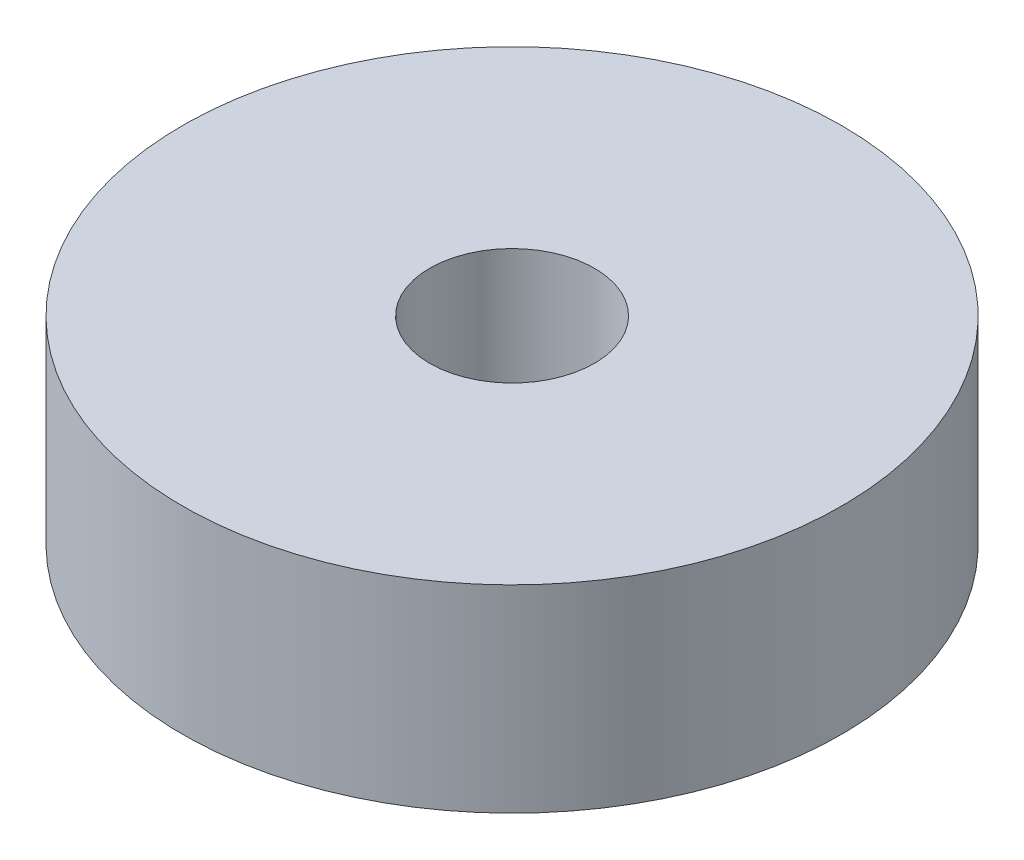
ISO-10303-21;
HEADER;
FILE_DESCRIPTION(('STEP AP214'),'2;1');
FILE_NAME('part.step','',(''),(''),'','','');
FILE_SCHEMA(('AUTOMOTIVE_DESIGN { 1 0 10303 214 1 1 1 1 }'));
ENDSEC;
DATA;
#1=APPLICATION_CONTEXT('core data for automotive mechanical design processes');
#2=APPLICATION_PROTOCOL_DEFINITION('international standard','automotive_design',2000,#1);
#3=PRODUCT_CONTEXT('',#1,'mechanical');
#4=PRODUCT('Part','Part','',(#3));
#5=PRODUCT_RELATED_PRODUCT_CATEGORY('part','',(#4));
#6=PRODUCT_DEFINITION_FORMATION('','',#4);
#7=PRODUCT_DEFINITION_CONTEXT('part definition',#1,'design');
#8=PRODUCT_DEFINITION('design','',#6,#7);
#9=PRODUCT_DEFINITION_SHAPE('','',#8);
#10=(LENGTH_UNIT() NAMED_UNIT(*) SI_UNIT(.MILLI.,.METRE.));
#11=(NAMED_UNIT(*) PLANE_ANGLE_UNIT() SI_UNIT($,.RADIAN.));
#12=(NAMED_UNIT(*) SI_UNIT($,.STERADIAN.) SOLID_ANGLE_UNIT());
#13=UNCERTAINTY_MEASURE_WITH_UNIT(LENGTH_MEASURE(1.E-05),#10,'distance_accuracy_value','');
#14=(GEOMETRIC_REPRESENTATION_CONTEXT(3) GLOBAL_UNCERTAINTY_ASSIGNED_CONTEXT((#13)) GLOBAL_UNIT_ASSIGNED_CONTEXT((#10,
#11,#12)) REPRESENTATION_CONTEXT('',''));
#15=CARTESIAN_POINT('',(0.,0.,0.));
#16=DIRECTION('',(0.,0.,1.));
#17=DIRECTION('',(1.,0.,0.));
#18=AXIS2_PLACEMENT_3D('',#15,#16,#17);
#19=CARTESIAN_POINT('',(0.,0.,0.));
#20=DIRECTION('',(0.,1.,0.));
#21=DIRECTION('',(0.,0.,1.));
#22=AXIS2_PLACEMENT_3D('',#19,#20,#21);
#23=PLANE('',#22);
#24=CARTESIAN_POINT('',(0.,0.,0.));
#25=DIRECTION('',(0.,1.,0.));
#26=DIRECTION('',(0.,0.,1.));
#27=AXIS2_PLACEMENT_3D('',#24,#25,#26);
#28=CIRCLE('',#27,3.175);
#29=CARTESIAN_POINT('',(0.,0.,3.175));
#30=VERTEX_POINT('',#29);
#31=EDGE_CURVE('E55',#30,#30,#28,.T.);
#32=ORIENTED_EDGE('',*,*,#31,.T.);
#33=EDGE_LOOP('',(#32));
#34=FACE_BOUND('',#33,.T.);
#35=CARTESIAN_POINT('',(0.,0.,0.));
#36=DIRECTION('',(0.,-1.,0.));
#37=DIRECTION('',(0.,0.,-1.));
#38=AXIS2_PLACEMENT_3D('',#35,#36,#37);
#39=CIRCLE('',#38,5.715);
#40=CARTESIAN_POINT('',(0.,0.,-5.715));
#41=VERTEX_POINT('',#40);
#42=EDGE_CURVE('E66',#41,#41,#39,.T.);
#43=ORIENTED_EDGE('',*,*,#42,.T.);
#44=EDGE_LOOP('',(#43));
#45=FACE_BOUND('',#44,.T.);
#46=ADVANCED_FACE('F31',(#34,#45),#23,.F.);
#47=CARTESIAN_POINT('',(0.,7.62,0.));
#48=DIRECTION('',(0.,-1.,0.));
#49=DIRECTION('',(0.,0.,-1.));
#50=AXIS2_PLACEMENT_3D('',#47,#48,#49);
#51=CYLINDRICAL_SURFACE('',#50,12.7);
#52=CARTESIAN_POINT('',(0.,7.62,0.));
#53=DIRECTION('',(0.,1.,0.));
#54=DIRECTION('',(0.,0.,1.));
#55=AXIS2_PLACEMENT_3D('',#52,#53,#54);
#56=CIRCLE('',#55,12.7);
#57=CARTESIAN_POINT('',(0.,7.62,-12.7));
#58=VERTEX_POINT('',#57);
#59=EDGE_CURVE('E51',#58,#58,#56,.T.);
#60=CARTESIAN_POINT('',(0.,0.,0.));
#61=DIRECTION('',(0.,1.,0.));
#62=DIRECTION('',(0.,0.,1.));
#63=AXIS2_PLACEMENT_3D('',#60,#61,#62);
#64=CIRCLE('',#63,12.7);
#65=CARTESIAN_POINT('',(0.,0.,-12.7));
#66=VERTEX_POINT('',#65);
#67=EDGE_CURVE('E52',#66,#66,#64,.T.);
#68=CARTESIAN_POINT('',(0.,7.62,-12.7));
#69=CARTESIAN_POINT('',(0.,7.540625,-12.7));
#70=CARTESIAN_POINT('',(0.,7.46125,-12.7));
#71=CARTESIAN_POINT('',(0.,7.3025,-12.7));
#72=CARTESIAN_POINT('',(0.,7.223125,-12.7));
#73=CARTESIAN_POINT('',(0.,7.064375,-12.7));
#74=CARTESIAN_POINT('',(0.,6.985,-12.7));
#75=CARTESIAN_POINT('',(0.,6.82625,-12.7));
#76=CARTESIAN_POINT('',(0.,6.746875,-12.7));
#77=CARTESIAN_POINT('',(0.,6.588125,-12.7));
#78=CARTESIAN_POINT('',(0.,6.50875,-12.7));
#79=CARTESIAN_POINT('',(0.,6.35,-12.7));
#80=CARTESIAN_POINT('',(0.,6.270625,-12.7));
#81=CARTESIAN_POINT('',(0.,6.111875,-12.7));
#82=CARTESIAN_POINT('',(0.,6.0325,-12.7));
#83=CARTESIAN_POINT('',(0.,5.87375,-12.7));
#84=CARTESIAN_POINT('',(0.,5.794375,-12.7));
#85=CARTESIAN_POINT('',(0.,5.635625,-12.7));
#86=CARTESIAN_POINT('',(0.,5.55625,-12.7));
#87=CARTESIAN_POINT('',(0.,5.3975,-12.7));
#88=CARTESIAN_POINT('',(0.,5.318125,-12.7));
#89=CARTESIAN_POINT('',(0.,5.159375,-12.7));
#90=CARTESIAN_POINT('',(0.,5.08,-12.7));
#91=CARTESIAN_POINT('',(0.,4.92125,-12.7));
#92=CARTESIAN_POINT('',(0.,4.841875,-12.7));
#93=CARTESIAN_POINT('',(0.,4.683125,-12.7));
#94=CARTESIAN_POINT('',(0.,4.60375,-12.7));
#95=CARTESIAN_POINT('',(0.,4.445,-12.7));
#96=CARTESIAN_POINT('',(0.,4.365625,-12.7));
#97=CARTESIAN_POINT('',(0.,4.206875,-12.7));
#98=CARTESIAN_POINT('',(0.,4.1275,-12.7));
#99=CARTESIAN_POINT('',(0.,3.96875,-12.7));
#100=CARTESIAN_POINT('',(0.,3.889375,-12.7));
#101=CARTESIAN_POINT('',(0.,3.730625,-12.7));
#102=CARTESIAN_POINT('',(0.,3.65125,-12.7));
#103=CARTESIAN_POINT('',(0.,3.4925,-12.7));
#104=CARTESIAN_POINT('',(0.,3.413125,-12.7));
#105=CARTESIAN_POINT('',(0.,3.254375,-12.7));
#106=CARTESIAN_POINT('',(0.,3.175,-12.7));
#107=CARTESIAN_POINT('',(0.,3.01625,-12.7));
#108=CARTESIAN_POINT('',(0.,2.936875,-12.7));
#109=CARTESIAN_POINT('',(0.,2.778125,-12.7));
#110=CARTESIAN_POINT('',(0.,2.69875,-12.7));
#111=CARTESIAN_POINT('',(0.,2.54,-12.7));
#112=CARTESIAN_POINT('',(0.,2.460625,-12.7));
#113=CARTESIAN_POINT('',(0.,2.301875,-12.7));
#114=CARTESIAN_POINT('',(0.,2.2225,-12.7));
#115=CARTESIAN_POINT('',(0.,2.06375,-12.7));
#116=CARTESIAN_POINT('',(0.,1.984375,-12.7));
#117=CARTESIAN_POINT('',(0.,1.825625,-12.7));
#118=CARTESIAN_POINT('',(0.,1.74625,-12.7));
#119=CARTESIAN_POINT('',(0.,1.5875,-12.7));
#120=CARTESIAN_POINT('',(0.,1.508125,-12.7));
#121=CARTESIAN_POINT('',(0.,1.349375,-12.7));
#122=CARTESIAN_POINT('',(0.,1.27,-12.7));
#123=CARTESIAN_POINT('',(0.,1.11125,-12.7));
#124=CARTESIAN_POINT('',(0.,1.031875,-12.7));
#125=CARTESIAN_POINT('',(0.,0.873125,-12.7));
#126=CARTESIAN_POINT('',(0.,0.79375,-12.7));
#127=CARTESIAN_POINT('',(0.,0.635,-12.7));
#128=CARTESIAN_POINT('',(0.,0.555625,-12.7));
#129=CARTESIAN_POINT('',(0.,0.396875,-12.7));
#130=CARTESIAN_POINT('',(0.,0.3175,-12.7));
#131=CARTESIAN_POINT('',(0.,0.15875,-12.7));
#132=CARTESIAN_POINT('',(0.,0.0793749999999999,-12.7));
#133=CARTESIAN_POINT('',(0.,0.,-12.7));
#134=B_SPLINE_CURVE_WITH_KNOTS('',3,(#68,#69,#70,#71,#72,#73,#74,#75,#76,#77,#78,#79,#80,#81,
#82,#83,#84,#85,#86,#87,#88,#89,#90,#91,#92,#93,#94,#95,#96,#97,#98,#99,#100,#101,#102,#103,
#104,#105,#106,#107,#108,#109,#110,#111,#112,#113,#114,#115,#116,#117,#118,#119,#120,#121,#122,
#123,#124,#125,#126,#127,#128,#129,#130,#131,#132,#133),.UNSPECIFIED.,.F.,.F.,(4,2,2,2,2,2,2,2,
2,2,2,2,2,2,2,2,2,2,2,2,2,2,2,2,2,2,2,2,2,2,2,2,4),(0.,0.238125,0.47625,0.714375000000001,
0.9525,1.190625,1.42875,1.666875,1.905,2.143125,2.38125,2.619375,2.8575,3.095625,3.33375,
3.571875,3.81,4.048125,4.28625,4.524375,4.7625,5.000625,5.23875,5.476875,5.715,5.953125,6.19125,
6.429375,6.6675,6.905625,7.14375,7.381875,7.62),.UNSPECIFIED.);
#135=EDGE_CURVE('BSEAM85',#58,#66,#134,.T.);
#136=ORIENTED_EDGE('',*,*,#59,.F.);
#137=ORIENTED_EDGE('',*,*,#67,.T.);
#138=ORIENTED_EDGE('',*,*,#135,.T.);
#139=ORIENTED_EDGE('',*,*,#135,.F.);
#140=EDGE_LOOP('',(#136,#138,#137,#139));
#141=FACE_BOUND('',#140,.T.);
#142=ADVANCED_FACE('F85',(#141),#51,.T.);
#143=CARTESIAN_POINT('',(0.,7.62,0.));
#144=DIRECTION('',(0.,1.,0.));
#145=DIRECTION('',(0.,0.,1.));
#146=AXIS2_PLACEMENT_3D('',#143,#144,#145);
#147=PLANE('',#146);
#148=CARTESIAN_POINT('',(0.,7.62,0.));
#149=DIRECTION('',(0.,1.,0.));
#150=DIRECTION('',(0.,0.,1.));
#151=AXIS2_PLACEMENT_3D('',#148,#149,#150);
#152=CIRCLE('',#151,3.175);
#153=CARTESIAN_POINT('',(0.,7.62,3.175));
#154=VERTEX_POINT('',#153);
#155=EDGE_CURVE('E58',#154,#154,#152,.T.);
#156=ORIENTED_EDGE('',*,*,#155,.F.);
#157=EDGE_LOOP('',(#156));
#158=FACE_BOUND('',#157,.T.);
#159=ORIENTED_EDGE('',*,*,#59,.T.);
#160=EDGE_LOOP('',(#159));
#161=FACE_BOUND('',#160,.T.);
#162=ADVANCED_FACE('F92',(#158,#161),#147,.T.);
#163=CARTESIAN_POINT('',(0.,0.,0.));
#164=DIRECTION('',(0.,-1.,0.));
#165=DIRECTION('',(0.,0.,-1.));
#166=AXIS2_PLACEMENT_3D('',#163,#164,#165);
#167=CIRCLE('',#166,10.16);
#168=CARTESIAN_POINT('',(0.,0.,-10.16));
#169=VERTEX_POINT('',#168);
#170=EDGE_CURVE('E61',#169,#169,#167,.T.);
#171=ORIENTED_EDGE('',*,*,#170,.F.);
#172=EDGE_LOOP('',(#171));
#173=FACE_BOUND('',#172,.T.);
#174=ORIENTED_EDGE('',*,*,#67,.F.);
#175=EDGE_LOOP('',(#174));
#176=FACE_BOUND('',#175,.T.);
#177=ADVANCED_FACE('F88',(#173,#176),#23,.F.);
#178=CARTESIAN_POINT('',(0.,0.,0.));
#179=DIRECTION('',(0.,1.,0.));
#180=DIRECTION('',(0.,0.,1.));
#181=AXIS2_PLACEMENT_3D('',#178,#179,#180);
#182=CYLINDRICAL_SURFACE('',#181,3.175);
#183=CARTESIAN_POINT('',(0.,0.,3.175));
#184=CARTESIAN_POINT('',(0.,0.0793749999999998,3.175));
#185=CARTESIAN_POINT('',(0.,0.15875,3.175));
#186=CARTESIAN_POINT('',(0.,0.3175,3.175));
#187=CARTESIAN_POINT('',(0.,0.396875,3.175));
#188=CARTESIAN_POINT('',(0.,0.555625,3.175));
#189=CARTESIAN_POINT('',(0.,0.635,3.175));
#190=CARTESIAN_POINT('',(0.,0.79375,3.175));
#191=CARTESIAN_POINT('',(0.,0.873125,3.175));
#192=CARTESIAN_POINT('',(0.,1.031875,3.175));
#193=CARTESIAN_POINT('',(0.,1.11125,3.175));
#194=CARTESIAN_POINT('',(0.,1.27,3.175));
#195=CARTESIAN_POINT('',(0.,1.349375,3.175));
#196=CARTESIAN_POINT('',(0.,1.508125,3.175));
#197=CARTESIAN_POINT('',(0.,1.5875,3.175));
#198=CARTESIAN_POINT('',(0.,1.74625,3.175));
#199=CARTESIAN_POINT('',(0.,1.825625,3.175));
#200=CARTESIAN_POINT('',(0.,1.984375,3.175));
#201=CARTESIAN_POINT('',(0.,2.06375,3.175));
#202=CARTESIAN_POINT('',(0.,2.2225,3.175));
#203=CARTESIAN_POINT('',(0.,2.301875,3.175));
#204=CARTESIAN_POINT('',(0.,2.460625,3.175));
#205=CARTESIAN_POINT('',(0.,2.54,3.175));
#206=CARTESIAN_POINT('',(0.,2.69875,3.175));
#207=CARTESIAN_POINT('',(0.,2.778125,3.175));
#208=CARTESIAN_POINT('',(0.,2.936875,3.175));
#209=CARTESIAN_POINT('',(0.,3.01625,3.175));
#210=CARTESIAN_POINT('',(0.,3.175,3.175));
#211=CARTESIAN_POINT('',(0.,3.254375,3.175));
#212=CARTESIAN_POINT('',(0.,3.413125,3.175));
#213=CARTESIAN_POINT('',(0.,3.4925,3.175));
#214=CARTESIAN_POINT('',(0.,3.65125,3.175));
#215=CARTESIAN_POINT('',(0.,3.730625,3.175));
#216=CARTESIAN_POINT('',(0.,3.889375,3.175));
#217=CARTESIAN_POINT('',(0.,3.96875,3.175));
#218=CARTESIAN_POINT('',(0.,4.1275,3.175));
#219=CARTESIAN_POINT('',(0.,4.206875,3.175));
#220=CARTESIAN_POINT('',(0.,4.365625,3.175));
#221=CARTESIAN_POINT('',(0.,4.445,3.175));
#222=CARTESIAN_POINT('',(0.,4.60375,3.175));
#223=CARTESIAN_POINT('',(0.,4.683125,3.175));
#224=CARTESIAN_POINT('',(0.,4.841875,3.175));
#225=CARTESIAN_POINT('',(0.,4.92125,3.175));
#226=CARTESIAN_POINT('',(0.,5.08,3.175));
#227=CARTESIAN_POINT('',(0.,5.159375,3.175));
#228=CARTESIAN_POINT('',(0.,5.318125,3.175));
#229=CARTESIAN_POINT('',(0.,5.3975,3.175));
#230=CARTESIAN_POINT('',(0.,5.55625,3.175));
#231=CARTESIAN_POINT('',(0.,5.635625,3.175));
#232=CARTESIAN_POINT('',(0.,5.794375,3.175));
#233=CARTESIAN_POINT('',(0.,5.87375,3.175));
#234=CARTESIAN_POINT('',(0.,6.0325,3.175));
#235=CARTESIAN_POINT('',(0.,6.111875,3.175));
#236=CARTESIAN_POINT('',(0.,6.270625,3.175));
#237=CARTESIAN_POINT('',(0.,6.35,3.175));
#238=CARTESIAN_POINT('',(0.,6.50875,3.175));
#239=CARTESIAN_POINT('',(0.,6.588125,3.175));
#240=CARTESIAN_POINT('',(0.,6.746875,3.175));
#241=CARTESIAN_POINT('',(0.,6.82625,3.175));
#242=CARTESIAN_POINT('',(0.,6.985,3.175));
#243=CARTESIAN_POINT('',(0.,7.064375,3.175));
#244=CARTESIAN_POINT('',(0.,7.223125,3.175));
#245=CARTESIAN_POINT('',(0.,7.3025,3.175));
#246=CARTESIAN_POINT('',(0.,7.46125,3.175));
#247=CARTESIAN_POINT('',(0.,7.540625,3.175));
#248=CARTESIAN_POINT('',(0.,7.62,3.175));
#249=B_SPLINE_CURVE_WITH_KNOTS('',3,(#183,#184,#185,#186,#187,#188,#189,#190,#191,#192,#193,
#194,#195,#196,#197,#198,#199,#200,#201,#202,#203,#204,#205,#206,#207,#208,#209,#210,#211,#212,
#213,#214,#215,#216,#217,#218,#219,#220,#221,#222,#223,#224,#225,#226,#227,#228,#229,#230,#231,
#232,#233,#234,#235,#236,#237,#238,#239,#240,#241,#242,#243,#244,#245,#246,#247,#248),
.UNSPECIFIED.,.F.,.F.,(4,2,2,2,2,2,2,2,2,2,2,2,2,2,2,2,2,2,2,2,2,2,2,2,2,2,2,2,2,2,2,2,4),(0.,
0.238125,0.47625,0.714375,0.9525,1.190625,1.42875,1.666875,1.905,2.143125,2.38125,2.619375,
2.8575,3.095625,3.33375,3.571875,3.81,4.048125,4.28625,4.524375,4.7625,5.000625,5.23875,
5.476875,5.715,5.953125,6.19125,6.429375,6.6675,6.905625,7.14375,7.381875,7.62),.UNSPECIFIED.);
#250=EDGE_CURVE('BSEAM97',#30,#154,#249,.T.);
#251=ORIENTED_EDGE('',*,*,#31,.F.);
#252=ORIENTED_EDGE('',*,*,#155,.T.);
#253=ORIENTED_EDGE('',*,*,#250,.T.);
#254=ORIENTED_EDGE('',*,*,#250,.F.);
#255=EDGE_LOOP('',(#251,#253,#252,#254));
#256=FACE_BOUND('',#255,.T.);
#257=ADVANCED_FACE('F97',(#256),#182,.F.);
#258=CARTESIAN_POINT('',(0.,5.08,0.));
#259=DIRECTION('',(0.,-1.,0.));
#260=DIRECTION('',(0.,0.,-1.));
#261=AXIS2_PLACEMENT_3D('',#258,#259,#260);
#262=CYLINDRICAL_SURFACE('',#261,10.16);
#263=CARTESIAN_POINT('',(0.,3.048,0.));
#264=DIRECTION('',(0.,-1.,0.));
#265=DIRECTION('',(0.,0.,-1.));
#266=AXIS2_PLACEMENT_3D('',#263,#264,#265);
#267=CIRCLE('',#266,10.16);
#268=CARTESIAN_POINT('',(0.,3.048,-10.16));
#269=VERTEX_POINT('',#268);
#270=EDGE_CURVE('E10',#269,#269,#267,.F.);
#271=ORIENTED_EDGE('',*,*,#270,.T.);
#272=EDGE_LOOP('',(#271));
#273=FACE_BOUND('',#272,.T.);
#274=ORIENTED_EDGE('',*,*,#170,.T.);
#275=EDGE_LOOP('',(#274));
#276=FACE_BOUND('',#275,.T.);
#277=ADVANCED_FACE('F82',(#273,#276),#262,.F.);
#278=CARTESIAN_POINT('',(0.,5.08,0.));
#279=DIRECTION('',(0.,-1.,0.));
#280=DIRECTION('',(0.,0.,-1.));
#281=AXIS2_PLACEMENT_3D('',#278,#279,#280);
#282=PLANE('',#281);
#283=CARTESIAN_POINT('',(0.,5.08,0.));
#284=DIRECTION('',(0.,-1.,0.));
#285=DIRECTION('',(0.,0.,-1.));
#286=AXIS2_PLACEMENT_3D('',#283,#284,#285);
#287=CIRCLE('',#286,7.747);
#288=CARTESIAN_POINT('',(0.,5.08,-7.747));
#289=VERTEX_POINT('',#288);
#290=EDGE_CURVE('E38',#289,#289,#287,.F.);
#291=ORIENTED_EDGE('',*,*,#290,.T.);
#292=EDGE_LOOP('',(#291));
#293=FACE_BOUND('',#292,.T.);
#294=CARTESIAN_POINT('',(0.,5.08,0.));
#295=DIRECTION('',(0.,-1.,0.));
#296=DIRECTION('',(0.,0.,-1.));
#297=AXIS2_PLACEMENT_3D('',#294,#295,#296);
#298=CIRCLE('',#297,8.128);
#299=CARTESIAN_POINT('',(0.,5.08,-8.128));
#300=VERTEX_POINT('',#299);
#301=EDGE_CURVE('E42',#300,#300,#298,.T.);
#302=ORIENTED_EDGE('',*,*,#301,.T.);
#303=EDGE_LOOP('',(#302));
#304=FACE_BOUND('',#303,.T.);
#305=ADVANCED_FACE('F74',(#293,#304),#282,.T.);
#306=CARTESIAN_POINT('',(0.,5.08,0.));
#307=DIRECTION('',(0.,-1.,0.));
#308=DIRECTION('',(0.,0.,-1.));
#309=AXIS2_PLACEMENT_3D('',#306,#307,#308);
#310=CYLINDRICAL_SURFACE('',#309,5.715);
#311=CARTESIAN_POINT('',(0.,3.048,0.));
#312=DIRECTION('',(0.,-1.,0.));
#313=DIRECTION('',(0.,0.,-1.));
#314=AXIS2_PLACEMENT_3D('',#311,#312,#313);
#315=CIRCLE('',#314,5.715);
#316=CARTESIAN_POINT('',(0.,3.048,-5.715));
#317=VERTEX_POINT('',#316);
#318=EDGE_CURVE('E46',#317,#317,#315,.T.);
#319=ORIENTED_EDGE('',*,*,#318,.T.);
#320=EDGE_LOOP('',(#319));
#321=FACE_BOUND('',#320,.T.);
#322=ORIENTED_EDGE('',*,*,#42,.F.);
#323=EDGE_LOOP('',(#322));
#324=FACE_BOUND('',#323,.T.);
#325=ADVANCED_FACE('F71',(#321,#324),#310,.T.);
#326=CARTESIAN_POINT('',(0.,3.048,0.));
#327=DIRECTION('',(0.,-1.,0.));
#328=DIRECTION('',(0.,0.,-1.));
#329=AXIS2_PLACEMENT_3D('',#326,#327,#328);
#330=TOROIDAL_SURFACE('',#329,7.747,2.032);
#331=ORIENTED_EDGE('',*,*,#290,.F.);
#332=EDGE_LOOP('',(#331));
#333=FACE_BOUND('',#332,.T.);
#334=ORIENTED_EDGE('',*,*,#318,.F.);
#335=EDGE_LOOP('',(#334));
#336=FACE_BOUND('',#335,.T.);
#337=ADVANCED_FACE('F73',(#333,#336),#330,.F.);
#338=CARTESIAN_POINT('',(0.,3.048,0.));
#339=DIRECTION('',(0.,-1.,0.));
#340=DIRECTION('',(0.,0.,-1.));
#341=AXIS2_PLACEMENT_3D('',#338,#339,#340);
#342=TOROIDAL_SURFACE('',#341,8.128,2.032);
#343=ORIENTED_EDGE('',*,*,#270,.F.);
#344=EDGE_LOOP('',(#343));
#345=FACE_BOUND('',#344,.T.);
#346=ORIENTED_EDGE('',*,*,#301,.F.);
#347=EDGE_LOOP('',(#346));
#348=FACE_BOUND('',#347,.T.);
#349=ADVANCED_FACE('F33',(#345,#348),#342,.F.);
#350=CLOSED_SHELL('',(#46,#142,#162,#177,#257,#277,#305,#325,#337,#349));
#351=MANIFOLD_SOLID_BREP('B2',#350);
#352=ADVANCED_BREP_SHAPE_REPRESENTATION('',(#18,#351),#14);
#353=SHAPE_DEFINITION_REPRESENTATION(#9,#352);
ENDSEC;
END-ISO-10303-21;
